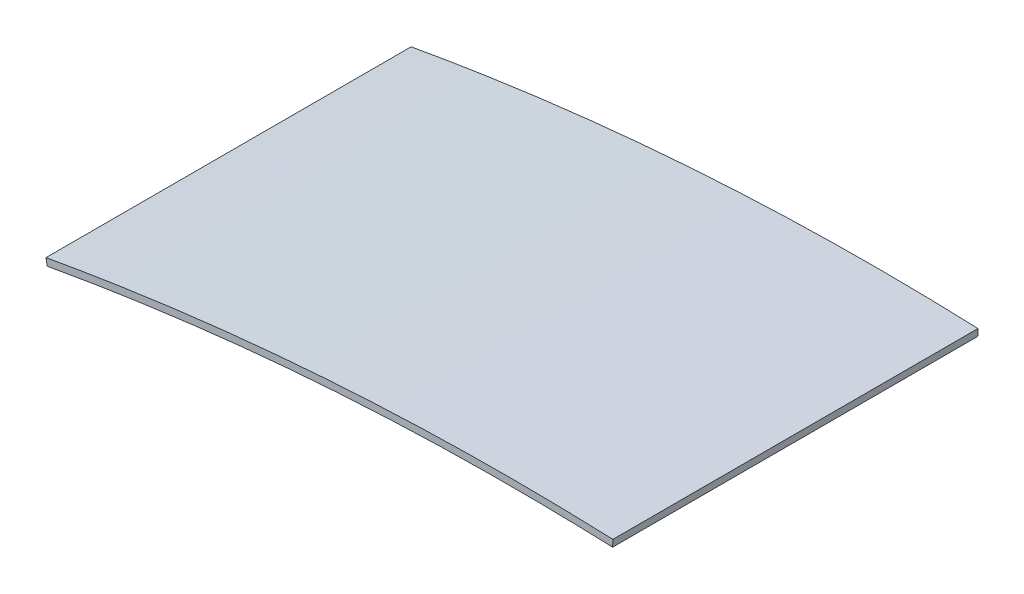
from build123d import *

# Parameters (mm, degrees)
BOSS_EXTRUDE1_DEPTH = 84


with BuildPart() as part:
    # Sketch1 → Boss-Extrude1 (new body)
    with BuildSketch(Plane.XY):
        with BuildLine():
            Line((-55.39342393, -1.146793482), (-55.109710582, -2.721438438))
            add(Edge.make_bspline(
                [(-55.109710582, -2.721438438), (-49.743443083, -1.754565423), (-38.975969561, 0.035649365), (-17.418543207, 3.02079367), (9.62352965, 5.645941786), (36.784142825, 6.79336536), (58.57607116, 6.825515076), (69.510793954, 6.545569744), (74.969745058, 6.332301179)],
                knots=[0, 0, 0, 0, 0.125, 0.25, 0.5, 0.75, 0.875, 1, 1, 1, 1], degree=3))
            Line((74.969745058, 6.332301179), (75.0322057, 7.931081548))
            add(Edge.make_bspline(
                [(-55.39342393, -1.146793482), (-37.807664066, 2.021739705), (5.443986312, 7.853081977), (49.073300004, 8.945235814), (75.0322057, 7.931081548)],
                knots=[0, 0, 0, 0, 0.408045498, 1, 1, 1, 1], degree=3))
        make_face()
    extrude(amount=BOSS_EXTRUDE1_DEPTH)


solid = part.part
